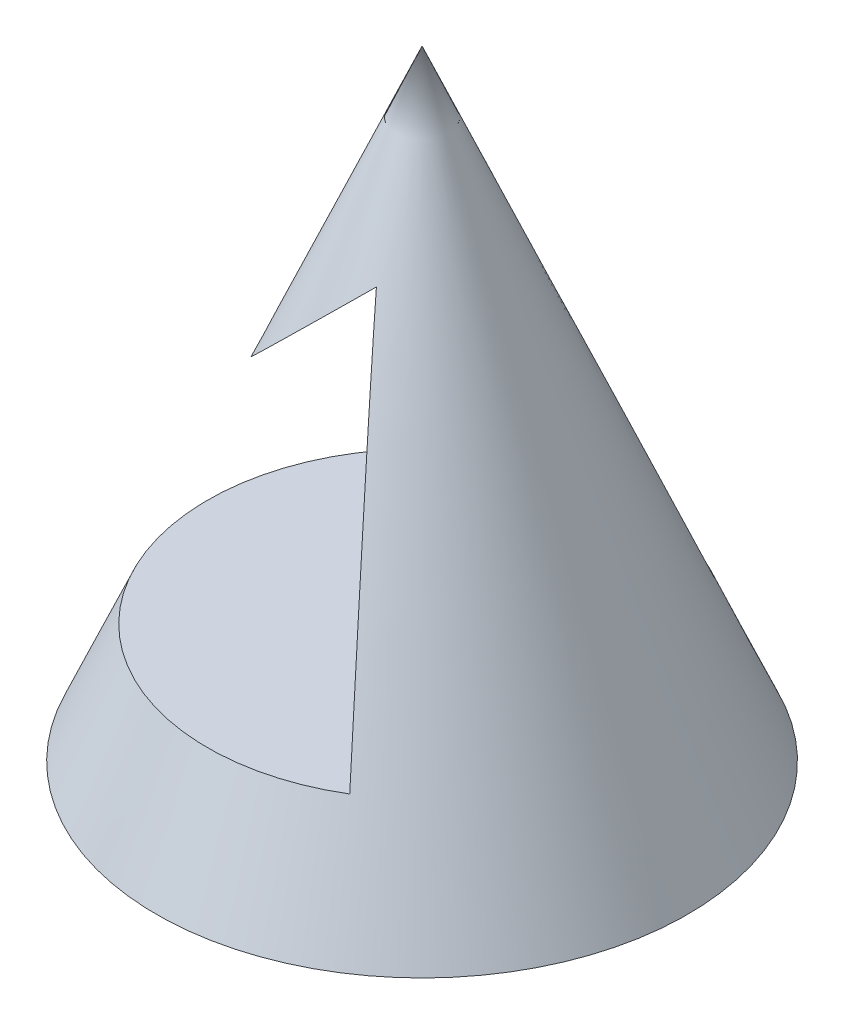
from build123d import *

# Parameters (mm, degrees)
CUT_EXTRUDE_1_DEPTH      = 82.853527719
CUT_EXTRUDE_1_DEPTH_BACK = 82.853527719


with BuildPart() as part:
    # Sketch 1 → Revolve 1 (revolve)
    with BuildSketch(Plane(origin=(0, 0, 0), x_dir=(0, 0, -1), z_dir=(1, 0, 0))):
        Polygon((0, 0), (30, 0), (0, 70), align=None)
    revolve(axis=Axis((0, 0, 0), (0, 1, 0)))

    # Sketch 2 → Cut-Extrude 1 (cut, two sides: drawn at the far end of the back side and taken through both)
    with BuildSketch(Plane.XY.offset(-CUT_EXTRUDE_1_DEPTH_BACK)):
        Polygon((-36.237810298, 13.440990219), (12.55792573, 13.440990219), (2.424030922, 51.422489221), align=None)
    extrude(amount=CUT_EXTRUDE_1_DEPTH + CUT_EXTRUDE_1_DEPTH_BACK, mode=Mode.SUBTRACT)


solid = part.part
